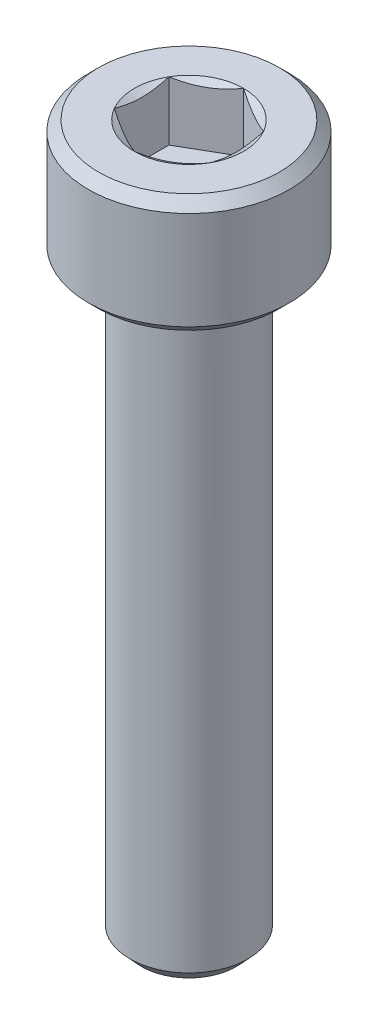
ISO-10303-21;
HEADER;
FILE_DESCRIPTION(('STEP AP214'),'2;1');
FILE_NAME('part.step','',(''),(''),'','','');
FILE_SCHEMA(('AUTOMOTIVE_DESIGN { 1 0 10303 214 1 1 1 1 }'));
ENDSEC;
DATA;
#1=APPLICATION_CONTEXT('core data for automotive mechanical design processes');
#2=APPLICATION_PROTOCOL_DEFINITION('international standard','automotive_design',2000,#1);
#3=PRODUCT_CONTEXT('',#1,'mechanical');
#4=PRODUCT('Part','Part','',(#3));
#5=PRODUCT_RELATED_PRODUCT_CATEGORY('part','',(#4));
#6=PRODUCT_DEFINITION_FORMATION('','',#4);
#7=PRODUCT_DEFINITION_CONTEXT('part definition',#1,'design');
#8=PRODUCT_DEFINITION('design','',#6,#7);
#9=PRODUCT_DEFINITION_SHAPE('','',#8);
#10=(LENGTH_UNIT() NAMED_UNIT(*) SI_UNIT(.MILLI.,.METRE.));
#11=(NAMED_UNIT(*) PLANE_ANGLE_UNIT() SI_UNIT($,.RADIAN.));
#12=(NAMED_UNIT(*) SI_UNIT($,.STERADIAN.) SOLID_ANGLE_UNIT());
#13=UNCERTAINTY_MEASURE_WITH_UNIT(LENGTH_MEASURE(1.E-05),#10,'distance_accuracy_value','');
#14=(GEOMETRIC_REPRESENTATION_CONTEXT(3) GLOBAL_UNCERTAINTY_ASSIGNED_CONTEXT((#13)) GLOBAL_UNIT_ASSIGNED_CONTEXT((#10,
#11,#12)) REPRESENTATION_CONTEXT('',''));
#15=CARTESIAN_POINT('',(0.,0.,0.));
#16=DIRECTION('',(0.,0.,1.));
#17=DIRECTION('',(1.,0.,0.));
#18=AXIS2_PLACEMENT_3D('',#15,#16,#17);
#19=CARTESIAN_POINT('',(0.,2.49999999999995,-2.3094010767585));
#20=DIRECTION('',(0.,1.,0.));
#21=DIRECTION('',(0.,0.,1.));
#22=AXIS2_PLACEMENT_3D('',#19,#20,#21);
#23=PLANE('',#22);
#24=DIRECTION('',(0.866025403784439,0.,-0.499999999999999));
#25=VECTOR('',#24,1.);
#26=CARTESIAN_POINT('',(0.,2.49999999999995,2.3094010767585));
#27=LINE('',#26,#25);
#28=CARTESIAN_POINT('',(0.,2.50000000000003,2.30940107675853));
#29=VERTEX_POINT('',#28);
#30=CARTESIAN_POINT('',(2.00000000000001,2.49999999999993,1.15470053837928));
#31=VERTEX_POINT('',#30);
#32=EDGE_CURVE('E85',#29,#31,#27,.T.);
#33=ORIENTED_EDGE('',*,*,#32,.T.);
#34=DIRECTION('',(0.,0.,-1.));
#35=VECTOR('',#34,1.);
#36=CARTESIAN_POINT('',(2.00000000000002,2.49999999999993,1.15470053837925));
#37=LINE('',#36,#35);
#38=CARTESIAN_POINT('',(2.00000000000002,2.49999999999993,-1.15470053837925));
#39=VERTEX_POINT('',#38);
#40=EDGE_CURVE('E71',#31,#39,#37,.T.);
#41=ORIENTED_EDGE('',*,*,#40,.T.);
#42=DIRECTION('',(-0.866025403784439,0.,-0.5));
#43=VECTOR('',#42,1.);
#44=CARTESIAN_POINT('',(2.00000000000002,2.49999999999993,-1.15470053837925));
#45=LINE('',#44,#43);
#46=CARTESIAN_POINT('',(0.,2.49999999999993,-2.3094010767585));
#47=VERTEX_POINT('',#46);
#48=EDGE_CURVE('E110',#39,#47,#45,.T.);
#49=ORIENTED_EDGE('',*,*,#48,.T.);
#50=DIRECTION('',(-0.86602540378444,0.,0.499999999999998));
#51=VECTOR('',#50,1.);
#52=CARTESIAN_POINT('',(0.,2.49999999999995,-2.3094010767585));
#53=LINE('',#52,#51);
#54=CARTESIAN_POINT('',(-1.99999999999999,2.49999999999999,-1.15470053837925));
#55=VERTEX_POINT('',#54);
#56=EDGE_CURVE('E115',#47,#55,#53,.T.);
#57=ORIENTED_EDGE('',*,*,#56,.T.);
#58=DIRECTION('',(0.,0.,1.));
#59=VECTOR('',#58,1.);
#60=CARTESIAN_POINT('',(-1.99999999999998,2.50000000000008,-1.15470053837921));
#61=LINE('',#60,#59);
#62=CARTESIAN_POINT('',(-1.99999999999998,2.50000000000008,1.15470053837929));
#63=VERTEX_POINT('',#62);
#64=EDGE_CURVE('E82',#55,#63,#61,.T.);
#65=ORIENTED_EDGE('',*,*,#64,.T.);
#66=DIRECTION('',(0.866025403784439,0.,0.5));
#67=VECTOR('',#66,1.);
#68=CARTESIAN_POINT('',(-1.99999999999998,2.50000000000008,1.15470053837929));
#69=LINE('',#68,#67);
#70=EDGE_CURVE('E84',#63,#29,#69,.T.);
#71=ORIENTED_EDGE('',*,*,#70,.T.);
#72=EDGE_LOOP('',(#33,#41,#49,#57,#65,#71));
#73=FACE_BOUND('',#72,.T.);
#74=ADVANCED_FACE('F17',(#73),#23,.T.);
#75=CARTESIAN_POINT('',(0.,2.49999999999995,2.3094010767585));
#76=DIRECTION('',(0.499999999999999,0.,0.866025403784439));
#77=DIRECTION('',(0.866025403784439,0.,-0.499999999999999));
#78=AXIS2_PLACEMENT_3D('',#75,#76,#77);
#79=PLANE('',#78);
#80=CARTESIAN_POINT('',(6.86445260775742E-12,5.00000000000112,2.30940107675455));
#81=CARTESIAN_POINT('',(0.0878878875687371,4.97069554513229,2.2586589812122));
#82=CARTESIAN_POINT('',(0.176534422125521,4.94404467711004,2.20747888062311));
#83=CARTESIAN_POINT('',(0.355362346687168,4.89752638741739,2.10423253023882));
#84=CARTESIAN_POINT('',(0.445546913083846,4.87767542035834,2.05216444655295));
#85=CARTESIAN_POINT('',(0.624798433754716,4.84677595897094,1.94867353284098));
#86=CARTESIAN_POINT('',(0.713837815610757,4.83552178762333,1.89726662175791));
#87=CARTESIAN_POINT('',(0.892335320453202,4.82208916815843,1.79421103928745));
#88=CARTESIAN_POINT('',(0.981792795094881,4.81989959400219,1.74256274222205));
#89=CARTESIAN_POINT('',(1.14893448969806,4.82446629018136,1.6460634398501));
#90=CARTESIAN_POINT('',(1.22664379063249,4.83010128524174,1.60119795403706));
#91=CARTESIAN_POINT('',(1.3815561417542,4.84795730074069,1.51175926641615));
#92=CARTESIAN_POINT('',(1.45875865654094,4.86018441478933,1.46718637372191));
#93=CARTESIAN_POINT('',(1.61399014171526,4.89074983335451,1.37756343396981));
#94=CARTESIAN_POINT('',(1.69199947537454,4.90921764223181,1.33252472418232));
#95=CARTESIAN_POINT('',(1.84685496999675,4.951131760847,1.2431188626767));
#96=CARTESIAN_POINT('',(1.92370311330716,4.97456822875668,1.19875056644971));
#97=CARTESIAN_POINT('',(1.99999999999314,5.00000000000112,1.15470053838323));
#98=B_SPLINE_CURVE_WITH_KNOTS('',3,(#80,#81,#82,#83,#84,#85,#86,#87,#88,#89,#90,#91,#92,#93,#94,
#95,#96,#97),.UNSPECIFIED.,.F.,.F.,(4,2,2,2,2,2,2,2,4),(0.,0.317016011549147,0.634793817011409,
0.944707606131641,1.2542408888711,1.5237077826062,1.79342419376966,2.06912162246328,
2.34427797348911),.UNSPECIFIED.);
#99=CARTESIAN_POINT('',(0.,4.99999999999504,2.30940107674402));
#100=VERTEX_POINT('',#99);
#101=CARTESIAN_POINT('',(1.99999999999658,4.99999999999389,1.15470053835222));
#102=VERTEX_POINT('',#101);
#103=EDGE_CURVE('E20',#100,#102,#98,.T.);
#104=ORIENTED_EDGE('',*,*,#103,.T.);
#105=DIRECTION('',(0.,1.,0.));
#106=VECTOR('',#105,1.);
#107=CARTESIAN_POINT('',(2.00000000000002,2.49999999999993,1.15470053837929));
#108=LINE('',#107,#106);
#109=EDGE_CURVE('E90',#102,#31,#108,.F.);
#110=ORIENTED_EDGE('',*,*,#109,.T.);
#111=ORIENTED_EDGE('',*,*,#32,.F.);
#112=DIRECTION('',(0.,1.,0.));
#113=VECTOR('',#112,1.);
#114=CARTESIAN_POINT('',(0.,2.50000000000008,2.30940107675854));
#115=LINE('',#114,#113);
#116=EDGE_CURVE('E58',#29,#100,#115,.T.);
#117=ORIENTED_EDGE('',*,*,#116,.T.);
#118=EDGE_LOOP('',(#104,#110,#111,#117));
#119=FACE_BOUND('',#118,.T.);
#120=ADVANCED_FACE('F89',(#119),#79,.F.);
#121=CARTESIAN_POINT('',(-1.99999999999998,2.50000000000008,1.15470053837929));
#122=DIRECTION('',(-0.5,0.,0.866025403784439));
#123=DIRECTION('',(0.866025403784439,0.,0.5));
#124=AXIS2_PLACEMENT_3D('',#121,#122,#123);
#125=PLANE('',#124);
#126=CARTESIAN_POINT('',(-1.99999999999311,5.00000000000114,1.15470053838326));
#127=CARTESIAN_POINT('',(-1.91211211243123,4.97069554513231,1.20544263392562));
#128=CARTESIAN_POINT('',(-1.82346557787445,4.94404467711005,1.2566227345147));
#129=CARTESIAN_POINT('',(-1.6446376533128,4.89752638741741,1.35986908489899));
#130=CARTESIAN_POINT('',(-1.55445308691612,4.87767542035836,1.41193716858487));
#131=CARTESIAN_POINT('',(-1.37520156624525,4.84677595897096,1.51542808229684));
#132=CARTESIAN_POINT('',(-1.28616218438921,4.83552178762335,1.56683499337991));
#133=CARTESIAN_POINT('',(-1.10766467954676,4.82208916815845,1.66989057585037));
#134=CARTESIAN_POINT('',(-1.01820720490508,4.81989959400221,1.72153887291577));
#135=CARTESIAN_POINT('',(-0.851065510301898,4.82446629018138,1.81803817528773));
#136=CARTESIAN_POINT('',(-0.773356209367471,4.83010128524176,1.86290366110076));
#137=CARTESIAN_POINT('',(-0.618443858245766,4.84795730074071,1.95234234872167));
#138=CARTESIAN_POINT('',(-0.541241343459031,4.86018441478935,1.99691524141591));
#139=CARTESIAN_POINT('',(-0.386009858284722,4.89074983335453,2.086538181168));
#140=CARTESIAN_POINT('',(-0.308000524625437,4.90921764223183,2.13157689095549));
#141=CARTESIAN_POINT('',(-0.153145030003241,4.95113176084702,2.22098275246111));
#142=CARTESIAN_POINT('',(-0.0762968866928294,4.97456822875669,2.2653510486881));
#143=CARTESIAN_POINT('',(-6.85384099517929E-12,5.00000000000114,2.30940107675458));
#144=B_SPLINE_CURVE_WITH_KNOTS('',3,(#126,#127,#128,#129,#130,#131,#132,#133,#134,#135,#136,
#137,#138,#139,#140,#141,#142,#143),.UNSPECIFIED.,.F.,.F.,(4,2,2,2,2,2,2,2,4),(0.,
0.317016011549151,0.634793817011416,0.944707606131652,1.25424088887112,1.52370778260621,
1.79342419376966,2.06912162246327,2.34427797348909),.UNSPECIFIED.);
#145=CARTESIAN_POINT('',(-1.9999999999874,4.99999999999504,1.15470053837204));
#146=VERTEX_POINT('',#145);
#147=EDGE_CURVE('E94',#146,#100,#144,.T.);
#148=ORIENTED_EDGE('',*,*,#147,.T.);
#149=ORIENTED_EDGE('',*,*,#116,.F.);
#150=ORIENTED_EDGE('',*,*,#70,.F.);
#151=DIRECTION('',(0.,1.,0.));
#152=VECTOR('',#151,1.);
#153=CARTESIAN_POINT('',(-1.99999999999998,2.50000000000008,1.15470053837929));
#154=LINE('',#153,#152);
#155=EDGE_CURVE('E96',#63,#146,#154,.T.);
#156=ORIENTED_EDGE('',*,*,#155,.T.);
#157=EDGE_LOOP('',(#148,#149,#150,#156));
#158=FACE_BOUND('',#157,.T.);
#159=ADVANCED_FACE('F92',(#158),#125,.F.);
#160=CARTESIAN_POINT('',(-1.99999999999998,2.50000000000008,-1.15470053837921));
#161=DIRECTION('',(-1.,0.,0.));
#162=DIRECTION('',(0.,0.,1.));
#163=AXIS2_PLACEMENT_3D('',#160,#161,#162);
#164=PLANE('',#163);
#165=CARTESIAN_POINT('',(-1.99999999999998,5.00000000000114,-1.15470053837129));
#166=CARTESIAN_POINT('',(-1.99999999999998,4.9706955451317,-1.05321634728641));
#167=CARTESIAN_POINT('',(-1.99999999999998,4.94404467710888,-0.950856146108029));
#168=CARTESIAN_POINT('',(-1.99999999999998,4.89752638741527,-0.744363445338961));
#169=CARTESIAN_POINT('',(-1.99999999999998,4.87767542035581,-0.640227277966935));
#170=CARTESIAN_POINT('',(-1.99999999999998,4.84677595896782,-0.43324545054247));
#171=CARTESIAN_POINT('',(-1.99999999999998,4.83552178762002,-0.330431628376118));
#172=CARTESIAN_POINT('',(-1.99999999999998,4.82208916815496,-0.124320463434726));
#173=CARTESIAN_POINT('',(-1.99999999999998,4.81989959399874,-0.0210238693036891));
#174=CARTESIAN_POINT('',(-1.99999999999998,4.82446629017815,0.171974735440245));
#175=CARTESIAN_POINT('',(-1.99999999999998,4.83010128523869,0.261705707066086));
#176=CARTESIAN_POINT('',(-1.99999999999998,4.84795730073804,0.440583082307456));
#177=CARTESIAN_POINT('',(-1.99999999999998,4.86018441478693,0.52972886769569));
#178=CARTESIAN_POINT('',(-1.99999999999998,4.89074983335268,0.708974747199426));
#179=CARTESIAN_POINT('',(-1.99999999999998,4.90921764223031,0.799052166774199));
#180=CARTESIAN_POINT('',(-1.99999999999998,4.95113176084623,0.977863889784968));
#181=CARTESIAN_POINT('',(-1.99999999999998,4.97456822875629,1.06660048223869));
#182=CARTESIAN_POINT('',(-1.99999999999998,5.00000000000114,1.15470053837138));
#183=B_SPLINE_CURVE_WITH_KNOTS('',3,(#165,#166,#167,#168,#169,#170,#171,#172,#173,#174,#175,
#176,#177,#178,#179,#180,#181,#182),.UNSPECIFIED.,.F.,.F.,(4,2,2,2,2,2,2,2,4),(0.,
0.317016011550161,0.634793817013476,0.944707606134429,1.25424088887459,1.52370778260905,
1.79342419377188,2.06912162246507,2.34427797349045),.UNSPECIFIED.);
#184=CARTESIAN_POINT('',(-1.99999999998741,4.99999999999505,-1.15470053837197));
#185=VERTEX_POINT('',#184);
#186=EDGE_CURVE('E195',#185,#146,#183,.T.);
#187=ORIENTED_EDGE('',*,*,#186,.T.);
#188=ORIENTED_EDGE('',*,*,#155,.F.);
#189=ORIENTED_EDGE('',*,*,#64,.F.);
#190=DIRECTION('',(0.,1.,0.));
#191=VECTOR('',#190,1.);
#192=CARTESIAN_POINT('',(-2.,2.49999999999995,-1.15470053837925));
#193=LINE('',#192,#191);
#194=EDGE_CURVE('E112',#55,#185,#193,.T.);
#195=ORIENTED_EDGE('',*,*,#194,.T.);
#196=EDGE_LOOP('',(#187,#188,#189,#195));
#197=FACE_BOUND('',#196,.T.);
#198=ADVANCED_FACE('F204',(#197),#164,.F.);
#199=CARTESIAN_POINT('',(0.,2.49999999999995,-2.3094010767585));
#200=DIRECTION('',(-0.499999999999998,0.,-0.86602540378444));
#201=DIRECTION('',(-0.86602540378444,0.,0.499999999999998));
#202=AXIS2_PLACEMENT_3D('',#199,#200,#201);
#203=PLANE('',#202);
#204=CARTESIAN_POINT('',(-6.86115962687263E-12,5.00000000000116,-2.30940107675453));
#205=CARTESIAN_POINT('',(-0.0878878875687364,4.97069554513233,-2.25865898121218));
#206=CARTESIAN_POINT('',(-0.176534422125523,4.94404467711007,-2.20747888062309));
#207=CARTESIAN_POINT('',(-0.355362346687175,4.89752638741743,-2.1042325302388));
#208=CARTESIAN_POINT('',(-0.445546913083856,4.87767542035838,-2.05216444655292));
#209=CARTESIAN_POINT('',(-0.624798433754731,4.84677595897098,-1.94867353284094));
#210=CARTESIAN_POINT('',(-0.713837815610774,4.83552178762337,-1.89726662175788));
#211=CARTESIAN_POINT('',(-0.892335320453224,4.82208916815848,-1.79421103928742));
#212=CARTESIAN_POINT('',(-0.981792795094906,4.81989959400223,-1.74256274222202));
#213=CARTESIAN_POINT('',(-1.14893448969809,4.8244662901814,-1.64606343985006));
#214=CARTESIAN_POINT('',(-1.22664379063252,4.83010128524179,-1.60119795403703));
#215=CARTESIAN_POINT('',(-1.38155614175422,4.84795730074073,-1.51175926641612));
#216=CARTESIAN_POINT('',(-1.45875865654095,4.86018441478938,-1.46718637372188));
#217=CARTESIAN_POINT('',(-1.61399014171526,4.89074983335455,-1.37756343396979));
#218=CARTESIAN_POINT('',(-1.69199947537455,4.90921764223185,-1.3325247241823));
#219=CARTESIAN_POINT('',(-1.84685496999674,4.95113176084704,-1.24311886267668));
#220=CARTESIAN_POINT('',(-1.92370311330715,4.97456822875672,-1.19875056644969));
#221=CARTESIAN_POINT('',(-1.99999999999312,5.00000000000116,-1.15470053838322));
#222=B_SPLINE_CURVE_WITH_KNOTS('',3,(#204,#205,#206,#207,#208,#209,#210,#211,#212,#213,#214,
#215,#216,#217,#218,#219,#220,#221),.UNSPECIFIED.,.F.,.F.,(4,2,2,2,2,2,2,2,4),(0.,
0.317016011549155,0.634793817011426,0.944707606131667,1.25424088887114,1.52370778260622,
1.79342419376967,2.06912162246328,2.3442779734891),.UNSPECIFIED.);
#223=CARTESIAN_POINT('',(0.,4.99999999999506,-2.30940107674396));
#224=VERTEX_POINT('',#223);
#225=EDGE_CURVE('E188',#224,#185,#222,.T.);
#226=ORIENTED_EDGE('',*,*,#225,.T.);
#227=ORIENTED_EDGE('',*,*,#194,.F.);
#228=ORIENTED_EDGE('',*,*,#56,.F.);
#229=DIRECTION('',(0.,1.,0.));
#230=VECTOR('',#229,1.);
#231=CARTESIAN_POINT('',(0.,2.49999999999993,-2.3094010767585));
#232=LINE('',#231,#230);
#233=EDGE_CURVE('E107',#47,#224,#232,.T.);
#234=ORIENTED_EDGE('',*,*,#233,.T.);
#235=EDGE_LOOP('',(#226,#227,#228,#234));
#236=FACE_BOUND('',#235,.T.);
#237=ADVANCED_FACE('F200',(#236),#203,.F.);
#238=CARTESIAN_POINT('',(2.00000000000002,2.49999999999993,-1.15470053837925));
#239=DIRECTION('',(0.5,0.,-0.866025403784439));
#240=DIRECTION('',(-0.866025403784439,0.,-0.5));
#241=AXIS2_PLACEMENT_3D('',#238,#239,#240);
#242=PLANE('',#241);
#243=CARTESIAN_POINT('',(1.99999999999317,5.00000000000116,-1.1547005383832));
#244=CARTESIAN_POINT('',(1.9121121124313,4.97069554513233,-1.20544263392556));
#245=CARTESIAN_POINT('',(1.82346557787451,4.94404467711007,-1.25662273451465));
#246=CARTESIAN_POINT('',(1.64463765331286,4.89752638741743,-1.35986908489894));
#247=CARTESIAN_POINT('',(1.55445308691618,4.87767542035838,-1.41193716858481));
#248=CARTESIAN_POINT('',(1.37520156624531,4.84677595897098,-1.51542808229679));
#249=CARTESIAN_POINT('',(1.28616218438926,4.83552178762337,-1.56683499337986));
#250=CARTESIAN_POINT('',(1.10766467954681,4.82208916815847,-1.66989057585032));
#251=CARTESIAN_POINT('',(1.01820720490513,4.81989959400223,-1.72153887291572));
#252=CARTESIAN_POINT('',(0.851065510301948,4.8244662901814,-1.81803817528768));
#253=CARTESIAN_POINT('',(0.77335620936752,4.83010128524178,-1.86290366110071));
#254=CARTESIAN_POINT('',(0.618443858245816,4.84795730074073,-1.95234234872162));
#255=CARTESIAN_POINT('',(0.541241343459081,4.86018441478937,-1.99691524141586));
#256=CARTESIAN_POINT('',(0.386009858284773,4.89074983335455,-2.08653818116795));
#257=CARTESIAN_POINT('',(0.308000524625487,4.90921764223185,-2.13157689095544));
#258=CARTESIAN_POINT('',(0.153145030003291,4.95113176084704,-2.22098275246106));
#259=CARTESIAN_POINT('',(0.0762968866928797,4.97456822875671,-2.26535104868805));
#260=CARTESIAN_POINT('',(6.90441857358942E-12,5.00000000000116,-2.30940107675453));
#261=B_SPLINE_CURVE_WITH_KNOTS('',3,(#243,#244,#245,#246,#247,#248,#249,#250,#251,#252,#253,
#254,#255,#256,#257,#258,#259,#260),.UNSPECIFIED.,.F.,.F.,(4,2,2,2,2,2,2,2,4),(0.,
0.317016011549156,0.634793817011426,0.944707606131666,1.25424088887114,1.52370778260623,
1.79342419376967,2.06912162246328,2.34427797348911),.UNSPECIFIED.);
#262=CARTESIAN_POINT('',(1.99999999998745,4.99999999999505,-1.15470053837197));
#263=VERTEX_POINT('',#262);
#264=EDGE_CURVE('E159',#263,#224,#261,.T.);
#265=ORIENTED_EDGE('',*,*,#264,.T.);
#266=ORIENTED_EDGE('',*,*,#233,.F.);
#267=ORIENTED_EDGE('',*,*,#48,.F.);
#268=DIRECTION('',(0.,1.,0.));
#269=VECTOR('',#268,1.);
#270=CARTESIAN_POINT('',(2.00000000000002,2.49999999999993,-1.15470053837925));
#271=LINE('',#270,#269);
#272=EDGE_CURVE('E39',#39,#263,#271,.T.);
#273=ORIENTED_EDGE('',*,*,#272,.T.);
#274=EDGE_LOOP('',(#265,#266,#267,#273));
#275=FACE_BOUND('',#274,.T.);
#276=ADVANCED_FACE('F203',(#275),#242,.F.);
#277=CARTESIAN_POINT('',(2.00000000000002,2.49999999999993,1.15470053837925));
#278=DIRECTION('',(1.,0.,0.));
#279=DIRECTION('',(0.,0.,-1.));
#280=AXIS2_PLACEMENT_3D('',#277,#278,#279);
#281=PLANE('',#280);
#282=CARTESIAN_POINT('',(2.00000000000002,5.00000000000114,1.15470053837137));
#283=CARTESIAN_POINT('',(2.00000000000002,4.97069554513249,1.05321634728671));
#284=CARTESIAN_POINT('',(2.00000000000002,4.94404467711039,0.950856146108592));
#285=CARTESIAN_POINT('',(2.00000000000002,4.89752638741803,0.744363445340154));
#286=CARTESIAN_POINT('',(2.00000000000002,4.87767542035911,0.640227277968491));
#287=CARTESIAN_POINT('',(2.00000000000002,4.84677595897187,0.433245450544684));
#288=CARTESIAN_POINT('',(2.00000000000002,4.83552178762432,0.330431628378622));
#289=CARTESIAN_POINT('',(2.00000000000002,4.82208916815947,0.124320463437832));
#290=CARTESIAN_POINT('',(2.00000000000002,4.81989959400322,0.0210238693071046));
#291=CARTESIAN_POINT('',(2.00000000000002,4.82446629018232,-0.171974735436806));
#292=CARTESIAN_POINT('',(2.00000000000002,4.83010128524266,-0.261705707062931));
#293=CARTESIAN_POINT('',(2.00000000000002,4.84795730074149,-0.440583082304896));
#294=CARTESIAN_POINT('',(2.00000000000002,4.86018441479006,-0.529728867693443));
#295=CARTESIAN_POINT('',(2.00000000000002,4.89074983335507,-0.708974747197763));
#296=CARTESIAN_POINT('',(2.00000000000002,4.90921764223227,-0.79905216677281));
#297=CARTESIAN_POINT('',(2.00000000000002,4.95113176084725,-0.977863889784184));
#298=CARTESIAN_POINT('',(2.00000000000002,4.97456822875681,-1.06660048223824));
#299=CARTESIAN_POINT('',(2.00000000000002,5.00000000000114,-1.15470053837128));
#300=B_SPLINE_CURVE_WITH_KNOTS('',3,(#282,#283,#284,#285,#286,#287,#288,#289,#290,#291,#292,
#293,#294,#295,#296,#297,#298,#299),.UNSPECIFIED.,.F.,.F.,(4,2,2,2,2,2,2,2,4),(0.,
0.317016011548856,0.634793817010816,0.944707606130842,1.2542408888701,1.52370778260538,
1.79342419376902,2.06912162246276,2.34427797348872),.UNSPECIFIED.);
#301=EDGE_CURVE('E152',#102,#263,#300,.T.);
#302=ORIENTED_EDGE('',*,*,#301,.T.);
#303=ORIENTED_EDGE('',*,*,#272,.F.);
#304=ORIENTED_EDGE('',*,*,#40,.F.);
#305=ORIENTED_EDGE('',*,*,#109,.F.);
#306=EDGE_LOOP('',(#302,#303,#304,#305));
#307=FACE_BOUND('',#306,.T.);
#308=ADVANCED_FACE('F166',(#307),#281,.F.);
#309=CARTESIAN_POINT('',(0.,5.0000000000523,0.));
#310=DIRECTION('',(0.,1.,0.));
#311=DIRECTION('',(0.,0.,1.));
#312=AXIS2_PLACEMENT_3D('',#309,#310,#311);
#313=CONICAL_SURFACE('',#312,2.30940107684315,1.04719755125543);
#314=ORIENTED_EDGE('',*,*,#103,.F.);
#315=CARTESIAN_POINT('',(0.,4.99999999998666,0.));
#316=DIRECTION('',(0.,1.,0.));
#317=DIRECTION('',(0.,0.,1.));
#318=AXIS2_PLACEMENT_3D('',#315,#316,#317);
#319=CIRCLE('',#318,2.30940107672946);
#320=EDGE_CURVE('E149',#102,#100,#319,.F.);
#321=ORIENTED_EDGE('',*,*,#320,.F.);
#322=EDGE_LOOP('',(#314,#321));
#323=FACE_BOUND('',#322,.T.);
#324=ADVANCED_FACE('F220',(#323),#313,.F.);
#325=CARTESIAN_POINT('',(0.,5.0000000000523,0.));
#326=DIRECTION('',(0.,1.,0.));
#327=DIRECTION('',(0.,0.,1.));
#328=AXIS2_PLACEMENT_3D('',#325,#326,#327);
#329=CONICAL_SURFACE('',#328,2.30940107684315,1.04719755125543);
#330=ORIENTED_EDGE('',*,*,#147,.F.);
#331=CARTESIAN_POINT('',(0.,4.99999999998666,0.));
#332=DIRECTION('',(0.,1.,0.));
#333=DIRECTION('',(0.,0.,1.));
#334=AXIS2_PLACEMENT_3D('',#331,#332,#333);
#335=CIRCLE('',#334,2.30940107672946);
#336=EDGE_CURVE('E146',#100,#146,#335,.F.);
#337=ORIENTED_EDGE('',*,*,#336,.F.);
#338=EDGE_LOOP('',(#330,#337));
#339=FACE_BOUND('',#338,.T.);
#340=ADVANCED_FACE('F217',(#339),#329,.F.);
#341=CARTESIAN_POINT('',(0.,5.0000000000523,0.));
#342=DIRECTION('',(0.,1.,0.));
#343=DIRECTION('',(0.,0.,1.));
#344=AXIS2_PLACEMENT_3D('',#341,#342,#343);
#345=CONICAL_SURFACE('',#344,2.30940107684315,1.04719755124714);
#346=ORIENTED_EDGE('',*,*,#186,.F.);
#347=CARTESIAN_POINT('',(0.,4.99999999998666,0.));
#348=DIRECTION('',(0.,1.,0.));
#349=DIRECTION('',(0.,0.,1.));
#350=AXIS2_PLACEMENT_3D('',#347,#348,#349);
#351=CIRCLE('',#350,2.30940107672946);
#352=EDGE_CURVE('E143',#146,#185,#351,.F.);
#353=ORIENTED_EDGE('',*,*,#352,.F.);
#354=EDGE_LOOP('',(#346,#353));
#355=FACE_BOUND('',#354,.T.);
#356=ADVANCED_FACE('F184',(#355),#345,.F.);
#357=CARTESIAN_POINT('',(0.,5.0000000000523,0.));
#358=DIRECTION('',(0.,1.,0.));
#359=DIRECTION('',(0.,0.,1.));
#360=AXIS2_PLACEMENT_3D('',#357,#358,#359);
#361=CONICAL_SURFACE('',#360,2.30940107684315,1.04719755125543);
#362=ORIENTED_EDGE('',*,*,#225,.F.);
#363=CARTESIAN_POINT('',(0.,4.99999999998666,0.));
#364=DIRECTION('',(0.,1.,0.));
#365=DIRECTION('',(0.,0.,1.));
#366=AXIS2_PLACEMENT_3D('',#363,#364,#365);
#367=CIRCLE('',#366,2.30940107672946);
#368=EDGE_CURVE('E140',#185,#224,#367,.F.);
#369=ORIENTED_EDGE('',*,*,#368,.F.);
#370=EDGE_LOOP('',(#362,#369));
#371=FACE_BOUND('',#370,.T.);
#372=ADVANCED_FACE('F179',(#371),#361,.F.);
#373=CARTESIAN_POINT('',(0.,5.0000000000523,0.));
#374=DIRECTION('',(0.,1.,0.));
#375=DIRECTION('',(0.,0.,1.));
#376=AXIS2_PLACEMENT_3D('',#373,#374,#375);
#377=CONICAL_SURFACE('',#376,2.30940107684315,1.04719755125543);
#378=ORIENTED_EDGE('',*,*,#264,.F.);
#379=CARTESIAN_POINT('',(0.,4.99999999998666,0.));
#380=DIRECTION('',(0.,1.,0.));
#381=DIRECTION('',(0.,0.,1.));
#382=AXIS2_PLACEMENT_3D('',#379,#380,#381);
#383=CIRCLE('',#382,2.30940107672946);
#384=EDGE_CURVE('E137',#224,#263,#383,.F.);
#385=ORIENTED_EDGE('',*,*,#384,.F.);
#386=EDGE_LOOP('',(#378,#385));
#387=FACE_BOUND('',#386,.T.);
#388=ADVANCED_FACE('F173',(#387),#377,.F.);
#389=CARTESIAN_POINT('',(0.,5.0000000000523,0.));
#390=DIRECTION('',(0.,1.,0.));
#391=DIRECTION('',(0.,0.,1.));
#392=AXIS2_PLACEMENT_3D('',#389,#390,#391);
#393=CONICAL_SURFACE('',#392,2.30940107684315,1.04719755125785);
#394=ORIENTED_EDGE('',*,*,#301,.F.);
#395=CARTESIAN_POINT('',(0.,4.99999999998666,0.));
#396=DIRECTION('',(0.,1.,0.));
#397=DIRECTION('',(0.,0.,1.));
#398=AXIS2_PLACEMENT_3D('',#395,#396,#397);
#399=CIRCLE('',#398,2.30940107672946);
#400=EDGE_CURVE('E134',#263,#102,#399,.F.);
#401=ORIENTED_EDGE('',*,*,#400,.F.);
#402=EDGE_LOOP('',(#394,#401));
#403=FACE_BOUND('',#402,.T.);
#404=ADVANCED_FACE('F168',(#403),#393,.F.);
#405=CARTESIAN_POINT('',(0.,5.00000000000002,0.));
#406=DIRECTION('',(0.,1.,0.));
#407=DIRECTION('',(0.,0.,1.));
#408=AXIS2_PLACEMENT_3D('',#405,#406,#407);
#409=PLANE('',#408);
#410=ORIENTED_EDGE('',*,*,#384,.T.);
#411=ORIENTED_EDGE('',*,*,#400,.T.);
#412=ORIENTED_EDGE('',*,*,#320,.T.);
#413=ORIENTED_EDGE('',*,*,#336,.T.);
#414=ORIENTED_EDGE('',*,*,#352,.T.);
#415=ORIENTED_EDGE('',*,*,#368,.T.);
#416=EDGE_LOOP('',(#410,#411,#412,#413,#414,#415));
#417=FACE_BOUND('',#416,.T.);
#418=CARTESIAN_POINT('',(0.,4.99999999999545,0.));
#419=DIRECTION('',(0.,-1.,0.));
#420=DIRECTION('',(0.,0.,-1.));
#421=AXIS2_PLACEMENT_3D('',#418,#419,#420);
#422=CIRCLE('',#421,3.82500000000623);
#423=CARTESIAN_POINT('',(0.,4.99999999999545,-3.82500000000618));
#424=VERTEX_POINT('',#423);
#425=EDGE_CURVE('E130',#424,#424,#422,.T.);
#426=ORIENTED_EDGE('',*,*,#425,.F.);
#427=EDGE_LOOP('',(#426));
#428=FACE_BOUND('',#427,.T.);
#429=ADVANCED_FACE('F172',(#417,#428),#409,.T.);
#430=CARTESIAN_POINT('',(0.,4.57499999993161,0.));
#431=DIRECTION('',(0.,-1.,0.));
#432=DIRECTION('',(0.,0.,-1.));
#433=AXIS2_PLACEMENT_3D('',#430,#431,#432);
#434=CONICAL_SURFACE('',#433,4.25000000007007,0.785398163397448);
#435=ORIENTED_EDGE('',*,*,#425,.T.);
#436=EDGE_LOOP('',(#435));
#437=FACE_BOUND('',#436,.T.);
#438=CARTESIAN_POINT('',(0.,4.57500000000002,0.));
#439=DIRECTION('',(0.,-1.,0.));
#440=DIRECTION('',(0.,0.,-1.));
#441=AXIS2_PLACEMENT_3D('',#438,#439,#440);
#442=CIRCLE('',#441,4.25);
#443=CARTESIAN_POINT('',(0.,4.57500000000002,-4.24999999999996));
#444=VERTEX_POINT('',#443);
#445=EDGE_CURVE('E133',#444,#444,#442,.T.);
#446=ORIENTED_EDGE('',*,*,#445,.F.);
#447=EDGE_LOOP('',(#446));
#448=FACE_BOUND('',#447,.T.);
#449=ADVANCED_FACE('F256',(#437,#448),#434,.T.);
#450=CARTESIAN_POINT('',(0.,5.00000000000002,0.));
#451=DIRECTION('',(0.,-1.,0.));
#452=DIRECTION('',(0.,0.,-1.));
#453=AXIS2_PLACEMENT_3D('',#450,#451,#452);
#454=CYLINDRICAL_SURFACE('',#453,4.25);
#455=ORIENTED_EDGE('',*,*,#445,.T.);
#456=EDGE_LOOP('',(#455));
#457=FACE_BOUND('',#456,.T.);
#458=CARTESIAN_POINT('',(0.,0.425000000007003,0.));
#459=DIRECTION('',(0.,1.,0.));
#460=DIRECTION('',(0.,0.,1.));
#461=AXIS2_PLACEMENT_3D('',#458,#459,#460);
#462=CIRCLE('',#461,4.24999999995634);
#463=CARTESIAN_POINT('',(0.,0.425000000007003,4.24999999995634));
#464=VERTEX_POINT('',#463);
#465=EDGE_CURVE('E129',#464,#464,#462,.F.);
#466=ORIENTED_EDGE('',*,*,#465,.F.);
#467=EDGE_LOOP('',(#466));
#468=FACE_BOUND('',#467,.T.);
#469=ADVANCED_FACE('F253',(#457,#468),#454,.T.);
#470=CARTESIAN_POINT('',(0.,-25.,0.));
#471=DIRECTION('',(0.,1.,0.));
#472=DIRECTION('',(0.,0.,1.));
#473=AXIS2_PLACEMENT_3D('',#470,#471,#472);
#474=PLANE('',#473);
#475=CARTESIAN_POINT('',(0.,-24.9999999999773,0.));
#476=DIRECTION('',(0.,1.,0.));
#477=DIRECTION('',(-1.,0.,0.));
#478=AXIS2_PLACEMENT_3D('',#475,#476,#477);
#479=CIRCLE('',#478,2.00000000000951);
#480=CARTESIAN_POINT('',(-2.00000000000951,-24.9999999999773,0.));
#481=VERTEX_POINT('',#480);
#482=EDGE_CURVE('E126',#481,#481,#479,.T.);
#483=ORIENTED_EDGE('',*,*,#482,.F.);
#484=EDGE_LOOP('',(#483));
#485=FACE_BOUND('',#484,.T.);
#486=ADVANCED_FACE('F249',(#485),#474,.F.);
#487=CARTESIAN_POINT('',(0.,0.425000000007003,0.));
#488=DIRECTION('',(0.,1.,0.));
#489=DIRECTION('',(-1.,0.,0.));
#490=AXIS2_PLACEMENT_3D('',#487,#488,#489);
#491=CONICAL_SURFACE('',#490,4.24999999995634,0.785398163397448);
#492=CARTESIAN_POINT('',(0.,5.6843418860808E-11,0.));
#493=DIRECTION('',(0.,1.,0.));
#494=DIRECTION('',(-1.,0.,0.));
#495=AXIS2_PLACEMENT_3D('',#492,#493,#494);
#496=CIRCLE('',#495,3.82500000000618);
#497=CARTESIAN_POINT('',(-3.82500000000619,5.68434432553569E-11,0.));
#498=VERTEX_POINT('',#497);
#499=EDGE_CURVE('E123',#498,#498,#496,.T.);
#500=ORIENTED_EDGE('',*,*,#499,.T.);
#501=EDGE_LOOP('',(#500));
#502=FACE_BOUND('',#501,.T.);
#503=ORIENTED_EDGE('',*,*,#465,.T.);
#504=EDGE_LOOP('',(#503));
#505=FACE_BOUND('',#504,.T.);
#506=ADVANCED_FACE('F245',(#502,#505),#491,.T.);
#507=CARTESIAN_POINT('',(0.,-24.4638156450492,0.));
#508=DIRECTION('',(0.,1.,0.));
#509=DIRECTION('',(-1.,0.,0.));
#510=AXIS2_PLACEMENT_3D('',#507,#508,#509);
#511=CONICAL_SURFACE('',#510,2.49999999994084,0.750491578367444);
#512=CARTESIAN_POINT('',(0.,-24.4638156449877,0.));
#513=DIRECTION('',(0.,1.,0.));
#514=DIRECTION('',(0.,0.,1.));
#515=AXIS2_PLACEMENT_3D('',#512,#513,#514);
#516=CIRCLE('',#515,2.5);
#517=CARTESIAN_POINT('',(0.,-24.4638156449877,2.50000000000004));
#518=VERTEX_POINT('',#517);
#519=EDGE_CURVE('E30',#518,#518,#516,.T.);
#520=ORIENTED_EDGE('',*,*,#519,.F.);
#521=EDGE_LOOP('',(#520));
#522=FACE_BOUND('',#521,.T.);
#523=ORIENTED_EDGE('',*,*,#482,.T.);
#524=EDGE_LOOP('',(#523));
#525=FACE_BOUND('',#524,.T.);
#526=ADVANCED_FACE('F238',(#522,#525),#511,.T.);
#527=CARTESIAN_POINT('',(0.,0.,0.));
#528=DIRECTION('',(0.,1.,0.));
#529=DIRECTION('',(0.,0.,1.));
#530=AXIS2_PLACEMENT_3D('',#527,#528,#529);
#531=PLANE('',#530);
#532=CARTESIAN_POINT('',(0.,0.,0.));
#533=DIRECTION('',(0.,1.,0.));
#534=DIRECTION('',(0.,0.,1.));
#535=AXIS2_PLACEMENT_3D('',#532,#533,#534);
#536=CIRCLE('',#535,2.5);
#537=CARTESIAN_POINT('',(0.,0.,2.50000000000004));
#538=VERTEX_POINT('',#537);
#539=EDGE_CURVE('E11',#538,#538,#536,.F.);
#540=ORIENTED_EDGE('',*,*,#539,.F.);
#541=EDGE_LOOP('',(#540));
#542=FACE_BOUND('',#541,.T.);
#543=ORIENTED_EDGE('',*,*,#499,.F.);
#544=EDGE_LOOP('',(#543));
#545=FACE_BOUND('',#544,.T.);
#546=ADVANCED_FACE('F232',(#542,#545),#531,.F.);
#547=CARTESIAN_POINT('',(0.,-25.,0.));
#548=DIRECTION('',(0.,1.,0.));
#549=DIRECTION('',(0.,0.,1.));
#550=AXIS2_PLACEMENT_3D('',#547,#548,#549);
#551=CYLINDRICAL_SURFACE('',#550,2.5);
#552=ORIENTED_EDGE('',*,*,#539,.T.);
#553=EDGE_LOOP('',(#552));
#554=FACE_BOUND('',#553,.T.);
#555=ORIENTED_EDGE('',*,*,#519,.T.);
#556=EDGE_LOOP('',(#555));
#557=FACE_BOUND('',#556,.T.);
#558=ADVANCED_FACE('F230',(#554,#557),#551,.T.);
#559=CLOSED_SHELL('',(#74,#120,#159,#198,#237,#276,#308,#324,#340,#356,#372,#388,#404,#429,#449,
#469,#486,#506,#526,#546,#558));
#560=MANIFOLD_SOLID_BREP('B1',#559);
#561=ADVANCED_BREP_SHAPE_REPRESENTATION('',(#18,#560),#14);
#562=SHAPE_DEFINITION_REPRESENTATION(#9,#561);
ENDSEC;
END-ISO-10303-21;
